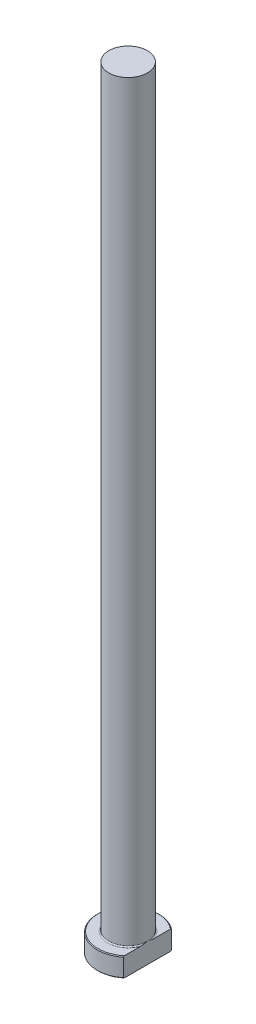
from build123d import *
from build123d.topology import SkipClean

# Parameters (mm, degrees)
CHAMFER1_SIZE = 0.2
FILLET1_R     = 0.3
KEY_DEPTH     = 201.319744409


with BuildPart() as part:
    # Sketch1 → Revolve1 (revolve)
    with BuildSketch(Plane.XY, mode=Mode.PRIVATE) as revolve1_sk:
        Polygon((0, 0), (-8, 0), (-8, 5), (-5, 5), (-5, 200), (0, 200), align=None)
    revolve(revolve1_sk.sketch.rotate(Axis((0, 259.958771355, 0), (0, -1, 0)), 270), axis=Axis((0, 259.958771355, 0), (0, -1, 0)))

    # Chamfer1
    chamfer1_edges = [part.edges().sort_by_distance(p)[0] for p in [
        (0, 5, -8),
        (0, 0, -8),
    ]]
    chamfer(chamfer1_edges, length=CHAMFER1_SIZE)

    # Fillet1
    fillet1_edges = [part.edges().sort_by_distance(p)[0] for p in [
        (0, 5, -5),
    ]]
    fillet(fillet1_edges, radius=FILLET1_R)

    # Sketch2 → KEY (cut, through all)
    with SkipClean():  # the faces are left unmerged after this step: merging them gives an invalid solid
        with BuildSketch(Plane(origin=(0, 0, 0), x_dir=(1, 0, 0), z_dir=(0, 1, 0))):
            with BuildLine():
                Line((5, 6.244997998), (5, -6.244997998))
                ThreePointArc((5, -6.244997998), (8, 0), (5, 6.244997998))
            make_face()
        extrude(amount=KEY_DEPTH, mode=Mode.SUBTRACT)


solid = part.part
